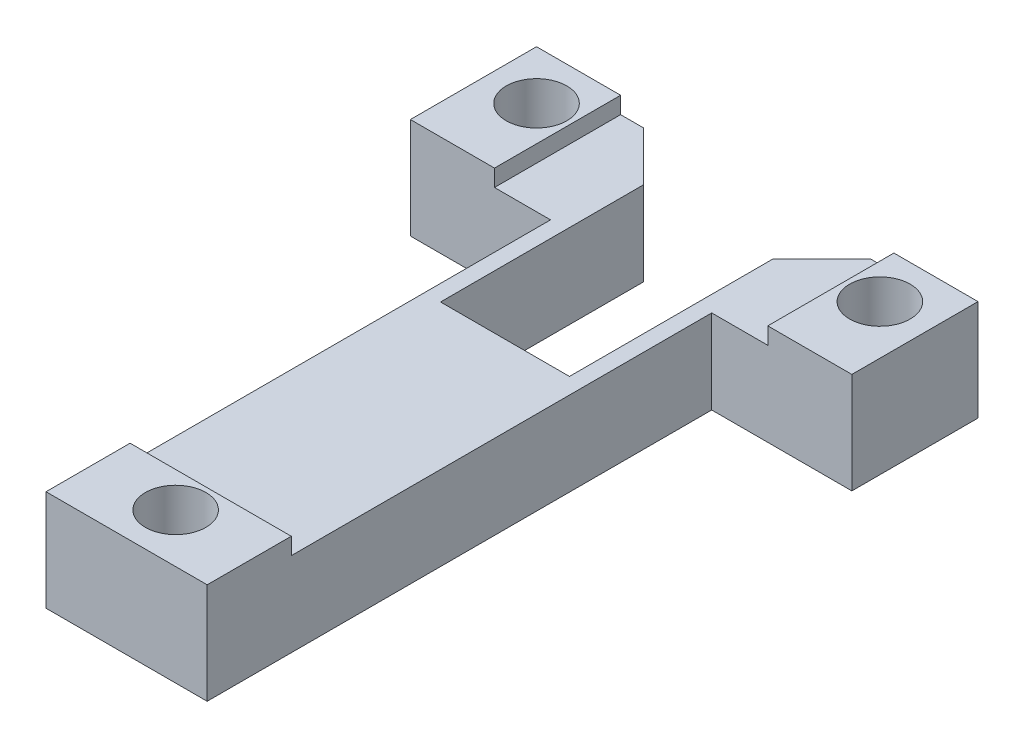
ISO-10303-21;
HEADER;
FILE_DESCRIPTION(('STEP AP214'),'2;1');
FILE_NAME('part.step','',(''),(''),'','','');
FILE_SCHEMA(('AUTOMOTIVE_DESIGN { 1 0 10303 214 1 1 1 1 }'));
ENDSEC;
DATA;
#1=APPLICATION_CONTEXT('core data for automotive mechanical design processes');
#2=APPLICATION_PROTOCOL_DEFINITION('international standard','automotive_design',2000,#1);
#3=PRODUCT_CONTEXT('',#1,'mechanical');
#4=PRODUCT('Part','Part','',(#3));
#5=PRODUCT_RELATED_PRODUCT_CATEGORY('part','',(#4));
#6=PRODUCT_DEFINITION_FORMATION('','',#4);
#7=PRODUCT_DEFINITION_CONTEXT('part definition',#1,'design');
#8=PRODUCT_DEFINITION('design','',#6,#7);
#9=PRODUCT_DEFINITION_SHAPE('','',#8);
#10=(LENGTH_UNIT() NAMED_UNIT(*) SI_UNIT(.MILLI.,.METRE.));
#11=(NAMED_UNIT(*) PLANE_ANGLE_UNIT() SI_UNIT($,.RADIAN.));
#12=(NAMED_UNIT(*) SI_UNIT($,.STERADIAN.) SOLID_ANGLE_UNIT());
#13=UNCERTAINTY_MEASURE_WITH_UNIT(LENGTH_MEASURE(1.E-05),#10,'distance_accuracy_value','');
#14=(GEOMETRIC_REPRESENTATION_CONTEXT(3) GLOBAL_UNCERTAINTY_ASSIGNED_CONTEXT((#13)) GLOBAL_UNIT_ASSIGNED_CONTEXT((#10,
#11,#12)) REPRESENTATION_CONTEXT('',''));
#15=CARTESIAN_POINT('',(0.,0.,0.));
#16=DIRECTION('',(0.,0.,1.));
#17=DIRECTION('',(1.,0.,0.));
#18=AXIS2_PLACEMENT_3D('',#15,#16,#17);
#19=CARTESIAN_POINT('',(0.,6.,0.));
#20=DIRECTION('',(0.,1.,0.));
#21=DIRECTION('',(0.,0.,1.));
#22=AXIS2_PLACEMENT_3D('',#19,#20,#21);
#23=PLANE('',#22);
#24=DIRECTION('',(-1.,0.,0.));
#25=VECTOR('',#24,1.);
#26=CARTESIAN_POINT('',(0.,6.,-45.));
#27=LINE('',#26,#25);
#28=CARTESIAN_POINT('',(15.5,6.,-45.));
#29=VERTEX_POINT('',#28);
#30=CARTESIAN_POINT('',(13.85,6.,-45.));
#31=VERTEX_POINT('',#30);
#32=EDGE_CURVE('E238',#29,#31,#27,.T.);
#33=ORIENTED_EDGE('',*,*,#32,.T.);
#34=DIRECTION('',(-0.707106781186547,0.,0.707106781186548));
#35=VECTOR('',#34,1.);
#36=CARTESIAN_POINT('',(-15.575,6.,-15.575));
#37=LINE('',#36,#35);
#38=CARTESIAN_POINT('',(10.35,6.,-41.5));
#39=VERTEX_POINT('',#38);
#40=EDGE_CURVE('E229',#31,#39,#37,.T.);
#41=ORIENTED_EDGE('',*,*,#40,.T.);
#42=DIRECTION('',(0.,0.,1.));
#43=VECTOR('',#42,1.);
#44=CARTESIAN_POINT('',(10.35,6.,0.));
#45=LINE('',#44,#43);
#46=CARTESIAN_POINT('',(10.35,6.,-27.));
#47=VERTEX_POINT('',#46);
#48=EDGE_CURVE('E380',#39,#47,#45,.T.);
#49=ORIENTED_EDGE('',*,*,#48,.T.);
#50=DIRECTION('',(-1.,0.,0.));
#51=VECTOR('',#50,1.);
#52=CARTESIAN_POINT('',(0.,6.,-27.));
#53=LINE('',#52,#51);
#54=CARTESIAN_POINT('',(1.15,6.,-27.));
#55=VERTEX_POINT('',#54);
#56=EDGE_CURVE('E345',#47,#55,#53,.T.);
#57=ORIENTED_EDGE('',*,*,#56,.T.);
#58=DIRECTION('',(0.,0.,1.));
#59=VECTOR('',#58,1.);
#60=CARTESIAN_POINT('',(1.15,6.,0.));
#61=LINE('',#60,#59);
#62=CARTESIAN_POINT('',(1.15,6.,-41.5));
#63=VERTEX_POINT('',#62);
#64=EDGE_CURVE('E227',#63,#55,#61,.T.);
#65=ORIENTED_EDGE('',*,*,#64,.F.);
#66=DIRECTION('',(0.707106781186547,0.,0.707106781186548));
#67=VECTOR('',#66,1.);
#68=CARTESIAN_POINT('',(21.325,6.,-21.325));
#69=LINE('',#68,#67);
#70=CARTESIAN_POINT('',(-2.35,6.,-45.));
#71=VERTEX_POINT('',#70);
#72=EDGE_CURVE('E212',#71,#63,#69,.T.);
#73=ORIENTED_EDGE('',*,*,#72,.F.);
#74=CARTESIAN_POINT('',(-4.,6.,-45.));
#75=VERTEX_POINT('',#74);
#76=EDGE_CURVE('E224',#71,#75,#27,.T.);
#77=ORIENTED_EDGE('',*,*,#76,.T.);
#78=DIRECTION('',(0.,0.,-1.));
#79=VECTOR('',#78,1.);
#80=CARTESIAN_POINT('',(-4.,6.,-45.));
#81=LINE('',#80,#79);
#82=CARTESIAN_POINT('',(-4.,6.,-36.));
#83=VERTEX_POINT('',#82);
#84=EDGE_CURVE('E420',#83,#75,#81,.T.);
#85=ORIENTED_EDGE('',*,*,#84,.F.);
#86=DIRECTION('',(1.,0.,0.));
#87=VECTOR('',#86,1.);
#88=CARTESIAN_POINT('',(0.,6.,-36.));
#89=LINE('',#88,#87);
#90=CARTESIAN_POINT('',(0.,6.,-36.));
#91=VERTEX_POINT('',#90);
#92=EDGE_CURVE('E239',#83,#91,#89,.T.);
#93=ORIENTED_EDGE('',*,*,#92,.T.);
#94=DIRECTION('',(0.,0.,-1.));
#95=VECTOR('',#94,1.);
#96=CARTESIAN_POINT('',(0.,6.,0.));
#97=LINE('',#96,#95);
#98=CARTESIAN_POINT('',(0.,6.,-6.));
#99=VERTEX_POINT('',#98);
#100=EDGE_CURVE('E297',#99,#91,#97,.T.);
#101=ORIENTED_EDGE('',*,*,#100,.F.);
#102=DIRECTION('',(-1.,0.,0.));
#103=VECTOR('',#102,1.);
#104=CARTESIAN_POINT('',(0.,6.,-6.));
#105=LINE('',#104,#103);
#106=CARTESIAN_POINT('',(11.5,6.,-6.));
#107=VERTEX_POINT('',#106);
#108=EDGE_CURVE('E393',#107,#99,#105,.T.);
#109=ORIENTED_EDGE('',*,*,#108,.F.);
#110=DIRECTION('',(0.,0.,-1.));
#111=VECTOR('',#110,1.);
#112=CARTESIAN_POINT('',(11.5,6.,0.));
#113=LINE('',#112,#111);
#114=CARTESIAN_POINT('',(11.5,6.,-36.));
#115=VERTEX_POINT('',#114);
#116=EDGE_CURVE('E294',#107,#115,#113,.T.);
#117=ORIENTED_EDGE('',*,*,#116,.T.);
#118=DIRECTION('',(-1.,0.,0.));
#119=VECTOR('',#118,1.);
#120=CARTESIAN_POINT('',(0.,6.,-36.));
#121=LINE('',#120,#119);
#122=CARTESIAN_POINT('',(15.5,6.,-36.));
#123=VERTEX_POINT('',#122);
#124=EDGE_CURVE('E272',#123,#115,#121,.T.);
#125=ORIENTED_EDGE('',*,*,#124,.F.);
#126=DIRECTION('',(0.,0.,1.));
#127=VECTOR('',#126,1.);
#128=CARTESIAN_POINT('',(15.5,6.,-45.));
#129=LINE('',#128,#127);
#130=EDGE_CURVE('E416',#29,#123,#129,.T.);
#131=ORIENTED_EDGE('',*,*,#130,.F.);
#132=EDGE_LOOP('',(#33,#41,#49,#57,#65,#73,#77,#85,#93,#101,#109,#117,#125,#131));
#133=FACE_BOUND('',#132,.T.);
#134=ADVANCED_FACE('F73',(#133),#23,.T.);
#135=CARTESIAN_POINT('',(0.,6.,-45.));
#136=DIRECTION('',(0.,0.,1.));
#137=DIRECTION('',(1.,0.,0.));
#138=AXIS2_PLACEMENT_3D('',#135,#136,#137);
#139=PLANE('',#138);
#140=DIRECTION('',(0.,-1.,0.));
#141=VECTOR('',#140,1.);
#142=CARTESIAN_POINT('',(13.85,7.2,-45.));
#143=LINE('',#142,#141);
#144=CARTESIAN_POINT('',(13.85,0.,-45.));
#145=VERTEX_POINT('',#144);
#146=EDGE_CURVE('E219',#31,#145,#143,.T.);
#147=ORIENTED_EDGE('',*,*,#146,.F.);
#148=ORIENTED_EDGE('',*,*,#32,.F.);
#149=DIRECTION('',(0.,-1.,0.));
#150=VECTOR('',#149,1.);
#151=CARTESIAN_POINT('',(15.5,7.2,-45.));
#152=LINE('',#151,#150);
#153=CARTESIAN_POINT('',(15.5,7.2,-45.));
#154=VERTEX_POINT('',#153);
#155=EDGE_CURVE('E396',#154,#29,#152,.T.);
#156=ORIENTED_EDGE('',*,*,#155,.F.);
#157=DIRECTION('',(-1.,0.,0.));
#158=VECTOR('',#157,1.);
#159=CARTESIAN_POINT('',(21.5,7.2,-45.));
#160=LINE('',#159,#158);
#161=CARTESIAN_POINT('',(21.5,7.2,-45.));
#162=VERTEX_POINT('',#161);
#163=EDGE_CURVE('E421',#162,#154,#160,.T.);
#164=ORIENTED_EDGE('',*,*,#163,.F.);
#165=DIRECTION('',(0.,-1.,0.));
#166=VECTOR('',#165,1.);
#167=CARTESIAN_POINT('',(21.5,6.,-45.));
#168=LINE('',#167,#166);
#169=CARTESIAN_POINT('',(21.5,0.,-45.));
#170=VERTEX_POINT('',#169);
#171=EDGE_CURVE('E288',#162,#170,#168,.T.);
#172=ORIENTED_EDGE('',*,*,#171,.T.);
#173=DIRECTION('',(-1.,0.,0.));
#174=VECTOR('',#173,1.);
#175=CARTESIAN_POINT('',(0.,0.,-45.));
#176=LINE('',#175,#174);
#177=EDGE_CURVE('E245',#170,#145,#176,.T.);
#178=ORIENTED_EDGE('',*,*,#177,.T.);
#179=EDGE_LOOP('',(#147,#148,#156,#164,#172,#178));
#180=FACE_BOUND('',#179,.T.);
#181=ADVANCED_FACE('F491',(#180),#139,.F.);
#182=CARTESIAN_POINT('',(-9.99999999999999,6.,0.));
#183=DIRECTION('',(1.,0.,0.));
#184=DIRECTION('',(0.,0.,-1.));
#185=AXIS2_PLACEMENT_3D('',#182,#183,#184);
#186=PLANE('',#185);
#187=DIRECTION('',(0.,0.,1.));
#188=VECTOR('',#187,1.);
#189=CARTESIAN_POINT('',(-9.99999999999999,0.,0.));
#190=LINE('',#189,#188);
#191=CARTESIAN_POINT('',(-10.,0.,-45.));
#192=VERTEX_POINT('',#191);
#193=CARTESIAN_POINT('',(-10.,0.,-36.));
#194=VERTEX_POINT('',#193);
#195=EDGE_CURVE('E249',#192,#194,#190,.T.);
#196=ORIENTED_EDGE('',*,*,#195,.T.);
#197=DIRECTION('',(0.,-1.,0.));
#198=VECTOR('',#197,1.);
#199=CARTESIAN_POINT('',(-10.,6.,-36.));
#200=LINE('',#199,#198);
#201=CARTESIAN_POINT('',(-10.,7.2,-36.));
#202=VERTEX_POINT('',#201);
#203=EDGE_CURVE('E268',#202,#194,#200,.T.);
#204=ORIENTED_EDGE('',*,*,#203,.F.);
#205=DIRECTION('',(0.,0.,1.));
#206=VECTOR('',#205,1.);
#207=CARTESIAN_POINT('',(-10.,7.2,-45.));
#208=LINE('',#207,#206);
#209=CARTESIAN_POINT('',(-10.,7.2,-45.));
#210=VERTEX_POINT('',#209);
#211=EDGE_CURVE('E439',#210,#202,#208,.T.);
#212=ORIENTED_EDGE('',*,*,#211,.F.);
#213=DIRECTION('',(0.,-1.,0.));
#214=VECTOR('',#213,1.);
#215=CARTESIAN_POINT('',(-10.,6.,-45.));
#216=LINE('',#215,#214);
#217=EDGE_CURVE('E243',#210,#192,#216,.T.);
#218=ORIENTED_EDGE('',*,*,#217,.T.);
#219=EDGE_LOOP('',(#196,#204,#212,#218));
#220=FACE_BOUND('',#219,.T.);
#221=ADVANCED_FACE('F472',(#220),#186,.F.);
#222=CARTESIAN_POINT('',(0.,6.,-36.));
#223=DIRECTION('',(0.,0.,-1.));
#224=DIRECTION('',(-1.,0.,0.));
#225=AXIS2_PLACEMENT_3D('',#222,#223,#224);
#226=PLANE('',#225);
#227=DIRECTION('',(1.,0.,0.));
#228=VECTOR('',#227,1.);
#229=CARTESIAN_POINT('',(0.,0.,-36.));
#230=LINE('',#229,#228);
#231=CARTESIAN_POINT('',(0.,0.,-36.));
#232=VERTEX_POINT('',#231);
#233=EDGE_CURVE('E253',#194,#232,#230,.T.);
#234=ORIENTED_EDGE('',*,*,#233,.T.);
#235=DIRECTION('',(0.,-1.,0.));
#236=VECTOR('',#235,1.);
#237=CARTESIAN_POINT('',(0.,6.,-36.));
#238=LINE('',#237,#236);
#239=EDGE_CURVE('E265',#91,#232,#238,.T.);
#240=ORIENTED_EDGE('',*,*,#239,.F.);
#241=ORIENTED_EDGE('',*,*,#92,.F.);
#242=DIRECTION('',(0.,-1.,0.));
#243=VECTOR('',#242,1.);
#244=CARTESIAN_POINT('',(-4.,7.2,-36.));
#245=LINE('',#244,#243);
#246=CARTESIAN_POINT('',(-4.,7.2,-36.));
#247=VERTEX_POINT('',#246);
#248=EDGE_CURVE('E307',#247,#83,#245,.T.);
#249=ORIENTED_EDGE('',*,*,#248,.F.);
#250=DIRECTION('',(1.,0.,0.));
#251=VECTOR('',#250,1.);
#252=CARTESIAN_POINT('',(-10.,7.2,-36.));
#253=LINE('',#252,#251);
#254=EDGE_CURVE('E443',#202,#247,#253,.T.);
#255=ORIENTED_EDGE('',*,*,#254,.F.);
#256=ORIENTED_EDGE('',*,*,#203,.T.);
#257=EDGE_LOOP('',(#234,#240,#241,#249,#255,#256));
#258=FACE_BOUND('',#257,.T.);
#259=ADVANCED_FACE('F461',(#258),#226,.F.);
#260=ORIENTED_EDGE('',*,*,#76,.F.);
#261=DIRECTION('',(0.,-1.,0.));
#262=VECTOR('',#261,1.);
#263=CARTESIAN_POINT('',(-2.35,7.2,-45.));
#264=LINE('',#263,#262);
#265=CARTESIAN_POINT('',(-2.35,0.,-45.));
#266=VERTEX_POINT('',#265);
#267=EDGE_CURVE('E209',#71,#266,#264,.T.);
#268=ORIENTED_EDGE('',*,*,#267,.T.);
#269=EDGE_CURVE('E258',#266,#192,#176,.T.);
#270=ORIENTED_EDGE('',*,*,#269,.T.);
#271=ORIENTED_EDGE('',*,*,#217,.F.);
#272=DIRECTION('',(-1.,0.,0.));
#273=VECTOR('',#272,1.);
#274=CARTESIAN_POINT('',(-4.,7.2,-45.));
#275=LINE('',#274,#273);
#276=CARTESIAN_POINT('',(-4.,7.2,-45.));
#277=VERTEX_POINT('',#276);
#278=EDGE_CURVE('E435',#277,#210,#275,.T.);
#279=ORIENTED_EDGE('',*,*,#278,.F.);
#280=DIRECTION('',(0.,-1.,0.));
#281=VECTOR('',#280,1.);
#282=CARTESIAN_POINT('',(-4.,7.2,-45.));
#283=LINE('',#282,#281);
#284=EDGE_CURVE('E236',#277,#75,#283,.T.);
#285=ORIENTED_EDGE('',*,*,#284,.T.);
#286=EDGE_LOOP('',(#260,#268,#270,#271,#279,#285));
#287=FACE_BOUND('',#286,.T.);
#288=ADVANCED_FACE('F233',(#287),#139,.F.);
#289=CARTESIAN_POINT('',(0.,0.,0.));
#290=DIRECTION('',(0.,1.,0.));
#291=DIRECTION('',(0.,0.,1.));
#292=AXIS2_PLACEMENT_3D('',#289,#290,#291);
#293=PLANE('',#292);
#294=CARTESIAN_POINT('',(5.75000000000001,0.,-3.5));
#295=DIRECTION('',(0.,1.,0.));
#296=DIRECTION('',(0.,0.,1.));
#297=AXIS2_PLACEMENT_3D('',#294,#295,#296);
#298=CIRCLE('',#297,2.16);
#299=CARTESIAN_POINT('',(5.75000000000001,0.,-1.34));
#300=VERTEX_POINT('',#299);
#301=EDGE_CURVE('E366',#300,#300,#298,.F.);
#302=ORIENTED_EDGE('',*,*,#301,.F.);
#303=EDGE_LOOP('',(#302));
#304=FACE_BOUND('',#303,.T.);
#305=DIRECTION('',(-0.707106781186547,0.,0.707106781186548));
#306=VECTOR('',#305,1.);
#307=CARTESIAN_POINT('',(-15.575,0.,-15.575));
#308=LINE('',#307,#306);
#309=CARTESIAN_POINT('',(10.35,0.,-41.5));
#310=VERTEX_POINT('',#309);
#311=EDGE_CURVE('E12',#145,#310,#308,.T.);
#312=ORIENTED_EDGE('',*,*,#311,.F.);
#313=ORIENTED_EDGE('',*,*,#177,.F.);
#314=DIRECTION('',(0.,0.,1.));
#315=VECTOR('',#314,1.);
#316=CARTESIAN_POINT('',(21.5,0.,0.));
#317=LINE('',#316,#315);
#318=CARTESIAN_POINT('',(21.5,0.,-36.));
#319=VERTEX_POINT('',#318);
#320=EDGE_CURVE('E277',#170,#319,#317,.T.);
#321=ORIENTED_EDGE('',*,*,#320,.T.);
#322=DIRECTION('',(-1.,0.,0.));
#323=VECTOR('',#322,1.);
#324=CARTESIAN_POINT('',(0.,0.,-36.));
#325=LINE('',#324,#323);
#326=CARTESIAN_POINT('',(11.5,0.,-36.));
#327=VERTEX_POINT('',#326);
#328=EDGE_CURVE('E278',#319,#327,#325,.T.);
#329=ORIENTED_EDGE('',*,*,#328,.T.);
#330=DIRECTION('',(0.,0.,-1.));
#331=VECTOR('',#330,1.);
#332=CARTESIAN_POINT('',(11.5,0.,0.));
#333=LINE('',#332,#331);
#334=CARTESIAN_POINT('',(11.5,0.,0.));
#335=VERTEX_POINT('',#334);
#336=EDGE_CURVE('E306',#335,#327,#333,.T.);
#337=ORIENTED_EDGE('',*,*,#336,.F.);
#338=DIRECTION('',(1.,0.,0.));
#339=VECTOR('',#338,1.);
#340=CARTESIAN_POINT('',(0.,0.,0.));
#341=LINE('',#340,#339);
#342=CARTESIAN_POINT('',(0.,0.,0.));
#343=VERTEX_POINT('',#342);
#344=EDGE_CURVE('E302',#343,#335,#341,.T.);
#345=ORIENTED_EDGE('',*,*,#344,.F.);
#346=DIRECTION('',(0.,0.,-1.));
#347=VECTOR('',#346,1.);
#348=CARTESIAN_POINT('',(0.,0.,0.));
#349=LINE('',#348,#347);
#350=EDGE_CURVE('E298',#343,#232,#349,.T.);
#351=ORIENTED_EDGE('',*,*,#350,.T.);
#352=ORIENTED_EDGE('',*,*,#233,.F.);
#353=ORIENTED_EDGE('',*,*,#195,.F.);
#354=ORIENTED_EDGE('',*,*,#269,.F.);
#355=DIRECTION('',(0.707106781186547,0.,0.707106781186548));
#356=VECTOR('',#355,1.);
#357=CARTESIAN_POINT('',(21.325,0.,-21.325));
#358=LINE('',#357,#356);
#359=CARTESIAN_POINT('',(1.15,0.,-41.5));
#360=VERTEX_POINT('',#359);
#361=EDGE_CURVE('E214',#266,#360,#358,.T.);
#362=ORIENTED_EDGE('',*,*,#361,.T.);
#363=DIRECTION('',(0.,0.,1.));
#364=VECTOR('',#363,1.);
#365=CARTESIAN_POINT('',(1.15,0.,0.));
#366=LINE('',#365,#364);
#367=CARTESIAN_POINT('',(1.15,0.,-27.));
#368=VERTEX_POINT('',#367);
#369=EDGE_CURVE('E321',#360,#368,#366,.T.);
#370=ORIENTED_EDGE('',*,*,#369,.T.);
#371=DIRECTION('',(-1.,0.,0.));
#372=VECTOR('',#371,1.);
#373=CARTESIAN_POINT('',(0.,0.,-27.));
#374=LINE('',#373,#372);
#375=CARTESIAN_POINT('',(10.35,0.,-27.));
#376=VERTEX_POINT('',#375);
#377=EDGE_CURVE('E325',#376,#368,#374,.T.);
#378=ORIENTED_EDGE('',*,*,#377,.F.);
#379=DIRECTION('',(0.,0.,1.));
#380=VECTOR('',#379,1.);
#381=CARTESIAN_POINT('',(10.35,0.,0.));
#382=LINE('',#381,#380);
#383=EDGE_CURVE('E82',#310,#376,#382,.T.);
#384=ORIENTED_EDGE('',*,*,#383,.F.);
#385=EDGE_LOOP('',(#312,#313,#321,#329,#337,#345,#351,#352,#353,#354,#362,#370,#378,#384));
#386=FACE_BOUND('',#385,.T.);
#387=CARTESIAN_POINT('',(-6.5,0.,-41.5));
#388=DIRECTION('',(0.,1.,0.));
#389=DIRECTION('',(0.,0.,1.));
#390=AXIS2_PLACEMENT_3D('',#387,#388,#389);
#391=CIRCLE('',#390,2.16);
#392=CARTESIAN_POINT('',(-6.5,0.,-39.34));
#393=VERTEX_POINT('',#392);
#394=EDGE_CURVE('E230',#393,#393,#391,.F.);
#395=ORIENTED_EDGE('',*,*,#394,.F.);
#396=EDGE_LOOP('',(#395));
#397=FACE_BOUND('',#396,.T.);
#398=CARTESIAN_POINT('',(18.,0.,-41.5));
#399=DIRECTION('',(0.,1.,0.));
#400=DIRECTION('',(0.,0.,1.));
#401=AXIS2_PLACEMENT_3D('',#398,#399,#400);
#402=CIRCLE('',#401,2.16);
#403=CARTESIAN_POINT('',(18.,0.,-39.34));
#404=VERTEX_POINT('',#403);
#405=EDGE_CURVE('E370',#404,#404,#402,.F.);
#406=ORIENTED_EDGE('',*,*,#405,.F.);
#407=EDGE_LOOP('',(#406));
#408=FACE_BOUND('',#407,.T.);
#409=ADVANCED_FACE('F349',(#304,#386,#397,#408),#293,.F.);
#410=CARTESIAN_POINT('',(21.5,6.,0.));
#411=DIRECTION('',(1.,0.,0.));
#412=DIRECTION('',(0.,0.,-1.));
#413=AXIS2_PLACEMENT_3D('',#410,#411,#412);
#414=PLANE('',#413);
#415=ORIENTED_EDGE('',*,*,#320,.F.);
#416=ORIENTED_EDGE('',*,*,#171,.F.);
#417=DIRECTION('',(0.,0.,-1.));
#418=VECTOR('',#417,1.);
#419=CARTESIAN_POINT('',(21.5,7.2,-36.));
#420=LINE('',#419,#418);
#421=CARTESIAN_POINT('',(21.5,7.2,-36.));
#422=VERTEX_POINT('',#421);
#423=EDGE_CURVE('E415',#422,#162,#420,.T.);
#424=ORIENTED_EDGE('',*,*,#423,.F.);
#425=DIRECTION('',(0.,-1.,0.));
#426=VECTOR('',#425,1.);
#427=CARTESIAN_POINT('',(21.5,6.,-36.));
#428=LINE('',#427,#426);
#429=EDGE_CURVE('E254',#422,#319,#428,.T.);
#430=ORIENTED_EDGE('',*,*,#429,.T.);
#431=EDGE_LOOP('',(#415,#416,#424,#430));
#432=FACE_BOUND('',#431,.T.);
#433=ADVANCED_FACE('F498',(#432),#414,.T.);
#434=CARTESIAN_POINT('',(0.,6.,-36.));
#435=DIRECTION('',(0.,0.,1.));
#436=DIRECTION('',(1.,0.,0.));
#437=AXIS2_PLACEMENT_3D('',#434,#435,#436);
#438=PLANE('',#437);
#439=ORIENTED_EDGE('',*,*,#328,.F.);
#440=ORIENTED_EDGE('',*,*,#429,.F.);
#441=DIRECTION('',(1.,0.,0.));
#442=VECTOR('',#441,1.);
#443=CARTESIAN_POINT('',(15.5,7.2,-36.));
#444=LINE('',#443,#442);
#445=CARTESIAN_POINT('',(15.5,7.2,-36.));
#446=VERTEX_POINT('',#445);
#447=EDGE_CURVE('E425',#446,#422,#444,.T.);
#448=ORIENTED_EDGE('',*,*,#447,.F.);
#449=DIRECTION('',(0.,-1.,0.));
#450=VECTOR('',#449,1.);
#451=CARTESIAN_POINT('',(15.5,7.2,-36.));
#452=LINE('',#451,#450);
#453=EDGE_CURVE('E412',#446,#123,#452,.T.);
#454=ORIENTED_EDGE('',*,*,#453,.T.);
#455=ORIENTED_EDGE('',*,*,#124,.T.);
#456=DIRECTION('',(0.,-1.,0.));
#457=VECTOR('',#456,1.);
#458=CARTESIAN_POINT('',(11.5,6.,-36.));
#459=LINE('',#458,#457);
#460=EDGE_CURVE('E276',#115,#327,#459,.T.);
#461=ORIENTED_EDGE('',*,*,#460,.T.);
#462=EDGE_LOOP('',(#439,#440,#448,#454,#455,#461));
#463=FACE_BOUND('',#462,.T.);
#464=ADVANCED_FACE('F510',(#463),#438,.T.);
#465=CARTESIAN_POINT('',(11.5,6.,0.));
#466=DIRECTION('',(-1.,0.,0.));
#467=DIRECTION('',(0.,0.,1.));
#468=AXIS2_PLACEMENT_3D('',#465,#466,#467);
#469=PLANE('',#468);
#470=ORIENTED_EDGE('',*,*,#460,.F.);
#471=ORIENTED_EDGE('',*,*,#116,.F.);
#472=DIRECTION('',(0.,-1.,0.));
#473=VECTOR('',#472,1.);
#474=CARTESIAN_POINT('',(11.5,7.2,-6.));
#475=LINE('',#474,#473);
#476=CARTESIAN_POINT('',(11.5,7.2,-6.));
#477=VERTEX_POINT('',#476);
#478=EDGE_CURVE('E387',#477,#107,#475,.T.);
#479=ORIENTED_EDGE('',*,*,#478,.F.);
#480=DIRECTION('',(0.,0.,-1.));
#481=VECTOR('',#480,1.);
#482=CARTESIAN_POINT('',(11.5,7.2,0.));
#483=LINE('',#482,#481);
#484=CARTESIAN_POINT('',(11.5,7.2,0.));
#485=VERTEX_POINT('',#484);
#486=EDGE_CURVE('E400',#485,#477,#483,.T.);
#487=ORIENTED_EDGE('',*,*,#486,.F.);
#488=DIRECTION('',(0.,-1.,0.));
#489=VECTOR('',#488,1.);
#490=CARTESIAN_POINT('',(11.5,6.,0.));
#491=LINE('',#490,#489);
#492=EDGE_CURVE('E282',#485,#335,#491,.T.);
#493=ORIENTED_EDGE('',*,*,#492,.T.);
#494=ORIENTED_EDGE('',*,*,#336,.T.);
#495=EDGE_LOOP('',(#470,#471,#479,#487,#493,#494));
#496=FACE_BOUND('',#495,.T.);
#497=ADVANCED_FACE('F514',(#496),#469,.F.);
#498=CARTESIAN_POINT('',(0.,6.,0.));
#499=DIRECTION('',(0.,0.,-1.));
#500=DIRECTION('',(-1.,0.,0.));
#501=AXIS2_PLACEMENT_3D('',#498,#499,#500);
#502=PLANE('',#501);
#503=ORIENTED_EDGE('',*,*,#344,.T.);
#504=ORIENTED_EDGE('',*,*,#492,.F.);
#505=DIRECTION('',(1.,0.,0.));
#506=VECTOR('',#505,1.);
#507=CARTESIAN_POINT('',(0.,7.2,0.));
#508=LINE('',#507,#506);
#509=CARTESIAN_POINT('',(0.,7.2,0.));
#510=VERTEX_POINT('',#509);
#511=EDGE_CURVE('E403',#510,#485,#508,.T.);
#512=ORIENTED_EDGE('',*,*,#511,.F.);
#513=DIRECTION('',(0.,-1.,0.));
#514=VECTOR('',#513,1.);
#515=CARTESIAN_POINT('',(0.,6.,0.));
#516=LINE('',#515,#514);
#517=EDGE_CURVE('E301',#510,#343,#516,.T.);
#518=ORIENTED_EDGE('',*,*,#517,.T.);
#519=EDGE_LOOP('',(#503,#504,#512,#518));
#520=FACE_BOUND('',#519,.T.);
#521=ADVANCED_FACE('F75',(#520),#502,.F.);
#522=CARTESIAN_POINT('',(0.,6.,0.));
#523=DIRECTION('',(-1.,0.,0.));
#524=DIRECTION('',(0.,0.,1.));
#525=AXIS2_PLACEMENT_3D('',#522,#523,#524);
#526=PLANE('',#525);
#527=ORIENTED_EDGE('',*,*,#517,.F.);
#528=DIRECTION('',(0.,0.,1.));
#529=VECTOR('',#528,1.);
#530=CARTESIAN_POINT('',(0.,7.2,-6.));
#531=LINE('',#530,#529);
#532=CARTESIAN_POINT('',(0.,7.2,-6.));
#533=VERTEX_POINT('',#532);
#534=EDGE_CURVE('E397',#533,#510,#531,.T.);
#535=ORIENTED_EDGE('',*,*,#534,.F.);
#536=DIRECTION('',(0.,-1.,0.));
#537=VECTOR('',#536,1.);
#538=CARTESIAN_POINT('',(0.,7.2,-6.));
#539=LINE('',#538,#537);
#540=EDGE_CURVE('E97',#533,#99,#539,.T.);
#541=ORIENTED_EDGE('',*,*,#540,.T.);
#542=ORIENTED_EDGE('',*,*,#100,.T.);
#543=ORIENTED_EDGE('',*,*,#239,.T.);
#544=ORIENTED_EDGE('',*,*,#350,.F.);
#545=EDGE_LOOP('',(#527,#535,#541,#542,#543,#544));
#546=FACE_BOUND('',#545,.T.);
#547=ADVANCED_FACE('F466',(#546),#526,.T.);
#548=CARTESIAN_POINT('',(-4.,7.2,-45.));
#549=DIRECTION('',(-1.,0.,0.));
#550=DIRECTION('',(0.,0.,1.));
#551=AXIS2_PLACEMENT_3D('',#548,#549,#550);
#552=PLANE('',#551);
#553=ORIENTED_EDGE('',*,*,#84,.T.);
#554=ORIENTED_EDGE('',*,*,#284,.F.);
#555=DIRECTION('',(0.,0.,-1.));
#556=VECTOR('',#555,1.);
#557=CARTESIAN_POINT('',(-4.,7.2,-45.));
#558=LINE('',#557,#556);
#559=EDGE_CURVE('E446',#247,#277,#558,.T.);
#560=ORIENTED_EDGE('',*,*,#559,.F.);
#561=ORIENTED_EDGE('',*,*,#248,.T.);
#562=EDGE_LOOP('',(#553,#554,#560,#561));
#563=FACE_BOUND('',#562,.T.);
#564=ADVANCED_FACE('F457',(#563),#552,.F.);
#565=CARTESIAN_POINT('',(0.,7.2,0.));
#566=DIRECTION('',(0.,1.,0.));
#567=DIRECTION('',(0.,0.,1.));
#568=AXIS2_PLACEMENT_3D('',#565,#566,#567);
#569=PLANE('',#568);
#570=CARTESIAN_POINT('',(-6.5,7.2,-41.5));
#571=DIRECTION('',(0.,1.,0.));
#572=DIRECTION('',(0.,0.,1.));
#573=AXIS2_PLACEMENT_3D('',#570,#571,#572);
#574=CIRCLE('',#573,2.16);
#575=CARTESIAN_POINT('',(-6.5,7.2,-39.34));
#576=VERTEX_POINT('',#575);
#577=EDGE_CURVE('E354',#576,#576,#574,.T.);
#578=ORIENTED_EDGE('',*,*,#577,.F.);
#579=EDGE_LOOP('',(#578));
#580=FACE_BOUND('',#579,.T.);
#581=ORIENTED_EDGE('',*,*,#278,.T.);
#582=ORIENTED_EDGE('',*,*,#211,.T.);
#583=ORIENTED_EDGE('',*,*,#254,.T.);
#584=ORIENTED_EDGE('',*,*,#559,.T.);
#585=EDGE_LOOP('',(#581,#582,#583,#584));
#586=FACE_BOUND('',#585,.T.);
#587=ADVANCED_FACE('F475',(#580,#586),#569,.T.);
#588=CARTESIAN_POINT('',(15.5,7.2,-45.));
#589=DIRECTION('',(1.,0.,0.));
#590=DIRECTION('',(0.,0.,-1.));
#591=AXIS2_PLACEMENT_3D('',#588,#589,#590);
#592=PLANE('',#591);
#593=ORIENTED_EDGE('',*,*,#130,.T.);
#594=ORIENTED_EDGE('',*,*,#453,.F.);
#595=DIRECTION('',(0.,0.,1.));
#596=VECTOR('',#595,1.);
#597=CARTESIAN_POINT('',(15.5,7.2,-45.));
#598=LINE('',#597,#596);
#599=EDGE_CURVE('E429',#154,#446,#598,.T.);
#600=ORIENTED_EDGE('',*,*,#599,.F.);
#601=ORIENTED_EDGE('',*,*,#155,.T.);
#602=EDGE_LOOP('',(#593,#594,#600,#601));
#603=FACE_BOUND('',#602,.T.);
#604=ADVANCED_FACE('F477',(#603),#592,.F.);
#605=CARTESIAN_POINT('',(0.,7.2,0.));
#606=DIRECTION('',(0.,1.,0.));
#607=DIRECTION('',(0.,0.,1.));
#608=AXIS2_PLACEMENT_3D('',#605,#606,#607);
#609=PLANE('',#608);
#610=CARTESIAN_POINT('',(18.,7.2,-41.5));
#611=DIRECTION('',(0.,1.,0.));
#612=DIRECTION('',(0.,0.,1.));
#613=AXIS2_PLACEMENT_3D('',#610,#611,#612);
#614=CIRCLE('',#613,2.16);
#615=CARTESIAN_POINT('',(18.,7.2,-39.34));
#616=VERTEX_POINT('',#615);
#617=EDGE_CURVE('E358',#616,#616,#614,.T.);
#618=ORIENTED_EDGE('',*,*,#617,.F.);
#619=EDGE_LOOP('',(#618));
#620=FACE_BOUND('',#619,.T.);
#621=ORIENTED_EDGE('',*,*,#163,.T.);
#622=ORIENTED_EDGE('',*,*,#599,.T.);
#623=ORIENTED_EDGE('',*,*,#447,.T.);
#624=ORIENTED_EDGE('',*,*,#423,.T.);
#625=EDGE_LOOP('',(#621,#622,#623,#624));
#626=FACE_BOUND('',#625,.T.);
#627=ADVANCED_FACE('F484',(#620,#626),#609,.T.);
#628=CARTESIAN_POINT('',(0.,7.2,-6.));
#629=DIRECTION('',(0.,0.,1.));
#630=DIRECTION('',(1.,0.,0.));
#631=AXIS2_PLACEMENT_3D('',#628,#629,#630);
#632=PLANE('',#631);
#633=ORIENTED_EDGE('',*,*,#108,.T.);
#634=ORIENTED_EDGE('',*,*,#540,.F.);
#635=DIRECTION('',(-1.,0.,0.));
#636=VECTOR('',#635,1.);
#637=CARTESIAN_POINT('',(0.,7.2,-6.));
#638=LINE('',#637,#636);
#639=EDGE_CURVE('E392',#477,#533,#638,.T.);
#640=ORIENTED_EDGE('',*,*,#639,.F.);
#641=ORIENTED_EDGE('',*,*,#478,.T.);
#642=EDGE_LOOP('',(#633,#634,#640,#641));
#643=FACE_BOUND('',#642,.T.);
#644=ADVANCED_FACE('F551',(#643),#632,.F.);
#645=CARTESIAN_POINT('',(0.,7.2,0.));
#646=DIRECTION('',(0.,1.,0.));
#647=DIRECTION('',(0.,0.,1.));
#648=AXIS2_PLACEMENT_3D('',#645,#646,#647);
#649=PLANE('',#648);
#650=CARTESIAN_POINT('',(5.75000000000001,7.2,-3.5));
#651=DIRECTION('',(0.,1.,0.));
#652=DIRECTION('',(0.,0.,1.));
#653=AXIS2_PLACEMENT_3D('',#650,#651,#652);
#654=CIRCLE('',#653,2.16);
#655=CARTESIAN_POINT('',(5.75000000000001,7.2,-1.34));
#656=VERTEX_POINT('',#655);
#657=EDGE_CURVE('E364',#656,#656,#654,.T.);
#658=ORIENTED_EDGE('',*,*,#657,.F.);
#659=EDGE_LOOP('',(#658));
#660=FACE_BOUND('',#659,.T.);
#661=ORIENTED_EDGE('',*,*,#534,.T.);
#662=ORIENTED_EDGE('',*,*,#511,.T.);
#663=ORIENTED_EDGE('',*,*,#486,.T.);
#664=ORIENTED_EDGE('',*,*,#639,.T.);
#665=EDGE_LOOP('',(#661,#662,#663,#664));
#666=FACE_BOUND('',#665,.T.);
#667=ADVANCED_FACE('F548',(#660,#666),#649,.T.);
#668=CARTESIAN_POINT('',(5.75000000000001,7.2,-3.5));
#669=DIRECTION('',(0.,-1.,0.));
#670=DIRECTION('',(0.,0.,-1.));
#671=AXIS2_PLACEMENT_3D('',#668,#669,#670);
#672=CYLINDRICAL_SURFACE('',#671,2.16);
#673=ORIENTED_EDGE('',*,*,#657,.T.);
#674=EDGE_LOOP('',(#673));
#675=FACE_BOUND('',#674,.T.);
#676=ORIENTED_EDGE('',*,*,#301,.T.);
#677=EDGE_LOOP('',(#676));
#678=FACE_BOUND('',#677,.T.);
#679=ADVANCED_FACE('F545',(#675,#678),#672,.F.);
#680=CARTESIAN_POINT('',(18.,7.2,-41.5));
#681=DIRECTION('',(0.,-1.,0.));
#682=DIRECTION('',(0.,0.,-1.));
#683=AXIS2_PLACEMENT_3D('',#680,#681,#682);
#684=CYLINDRICAL_SURFACE('',#683,2.16);
#685=ORIENTED_EDGE('',*,*,#617,.T.);
#686=EDGE_LOOP('',(#685));
#687=FACE_BOUND('',#686,.T.);
#688=ORIENTED_EDGE('',*,*,#405,.T.);
#689=EDGE_LOOP('',(#688));
#690=FACE_BOUND('',#689,.T.);
#691=ADVANCED_FACE('F567',(#687,#690),#684,.F.);
#692=CARTESIAN_POINT('',(-6.5,7.2,-41.5));
#693=DIRECTION('',(0.,-1.,0.));
#694=DIRECTION('',(0.,0.,-1.));
#695=AXIS2_PLACEMENT_3D('',#692,#693,#694);
#696=CYLINDRICAL_SURFACE('',#695,2.16);
#697=ORIENTED_EDGE('',*,*,#577,.T.);
#698=EDGE_LOOP('',(#697));
#699=FACE_BOUND('',#698,.T.);
#700=ORIENTED_EDGE('',*,*,#394,.T.);
#701=EDGE_LOOP('',(#700));
#702=FACE_BOUND('',#701,.T.);
#703=ADVANCED_FACE('F564',(#699,#702),#696,.F.);
#704=CARTESIAN_POINT('',(1.15,7.2,0.));
#705=DIRECTION('',(-1.,0.,0.));
#706=DIRECTION('',(0.,0.,1.));
#707=AXIS2_PLACEMENT_3D('',#704,#705,#706);
#708=PLANE('',#707);
#709=ORIENTED_EDGE('',*,*,#64,.T.);
#710=DIRECTION('',(0.,-1.,0.));
#711=VECTOR('',#710,1.);
#712=CARTESIAN_POINT('',(1.15,7.2,-27.));
#713=LINE('',#712,#711);
#714=EDGE_CURVE('E347',#55,#368,#713,.T.);
#715=ORIENTED_EDGE('',*,*,#714,.T.);
#716=ORIENTED_EDGE('',*,*,#369,.F.);
#717=DIRECTION('',(0.,-1.,0.));
#718=VECTOR('',#717,1.);
#719=CARTESIAN_POINT('',(1.15,7.2,-41.5));
#720=LINE('',#719,#718);
#721=EDGE_CURVE('E89',#63,#360,#720,.T.);
#722=ORIENTED_EDGE('',*,*,#721,.F.);
#723=EDGE_LOOP('',(#709,#715,#716,#722));
#724=FACE_BOUND('',#723,.T.);
#725=ADVANCED_FACE('F352',(#724),#708,.F.);
#726=CARTESIAN_POINT('',(0.,7.2,-27.));
#727=DIRECTION('',(0.,0.,-1.));
#728=DIRECTION('',(-1.,0.,0.));
#729=AXIS2_PLACEMENT_3D('',#726,#727,#728);
#730=PLANE('',#729);
#731=DIRECTION('',(0.,-1.,0.));
#732=VECTOR('',#731,1.);
#733=CARTESIAN_POINT('',(10.35,7.2,-27.));
#734=LINE('',#733,#732);
#735=EDGE_CURVE('E334',#47,#376,#734,.T.);
#736=ORIENTED_EDGE('',*,*,#735,.T.);
#737=ORIENTED_EDGE('',*,*,#377,.T.);
#738=ORIENTED_EDGE('',*,*,#714,.F.);
#739=ORIENTED_EDGE('',*,*,#56,.F.);
#740=EDGE_LOOP('',(#736,#737,#738,#739));
#741=FACE_BOUND('',#740,.T.);
#742=ADVANCED_FACE('F342',(#741),#730,.T.);
#743=CARTESIAN_POINT('',(10.35,7.2,0.));
#744=DIRECTION('',(-1.,0.,0.));
#745=DIRECTION('',(0.,0.,1.));
#746=AXIS2_PLACEMENT_3D('',#743,#744,#745);
#747=PLANE('',#746);
#748=DIRECTION('',(0.,-1.,0.));
#749=VECTOR('',#748,1.);
#750=CARTESIAN_POINT('',(10.35,7.2,-41.5));
#751=LINE('',#750,#749);
#752=EDGE_CURVE('E337',#39,#310,#751,.T.);
#753=ORIENTED_EDGE('',*,*,#752,.T.);
#754=ORIENTED_EDGE('',*,*,#383,.T.);
#755=ORIENTED_EDGE('',*,*,#735,.F.);
#756=ORIENTED_EDGE('',*,*,#48,.F.);
#757=EDGE_LOOP('',(#753,#754,#755,#756));
#758=FACE_BOUND('',#757,.T.);
#759=ADVANCED_FACE('F333',(#758),#747,.T.);
#760=CARTESIAN_POINT('',(-15.575,7.2,-15.575));
#761=DIRECTION('',(-0.707106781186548,0.,-0.707106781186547));
#762=DIRECTION('',(-0.707106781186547,0.,0.707106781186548));
#763=AXIS2_PLACEMENT_3D('',#760,#761,#762);
#764=PLANE('',#763);
#765=ORIENTED_EDGE('',*,*,#146,.T.);
#766=ORIENTED_EDGE('',*,*,#311,.T.);
#767=ORIENTED_EDGE('',*,*,#752,.F.);
#768=ORIENTED_EDGE('',*,*,#40,.F.);
#769=EDGE_LOOP('',(#765,#766,#767,#768));
#770=FACE_BOUND('',#769,.T.);
#771=ADVANCED_FACE('F578',(#770),#764,.T.);
#772=CARTESIAN_POINT('',(21.325,7.2,-21.325));
#773=DIRECTION('',(-0.707106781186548,0.,0.707106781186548));
#774=DIRECTION('',(0.707106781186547,0.,0.707106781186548));
#775=AXIS2_PLACEMENT_3D('',#772,#773,#774);
#776=PLANE('',#775);
#777=ORIENTED_EDGE('',*,*,#72,.T.);
#778=ORIENTED_EDGE('',*,*,#721,.T.);
#779=ORIENTED_EDGE('',*,*,#361,.F.);
#780=ORIENTED_EDGE('',*,*,#267,.F.);
#781=EDGE_LOOP('',(#777,#778,#779,#780));
#782=FACE_BOUND('',#781,.T.);
#783=ADVANCED_FACE('F211',(#782),#776,.F.);
#784=CLOSED_SHELL('',(#134,#181,#221,#259,#288,#409,#433,#464,#497,#521,#547,#564,#587,#604,
#627,#644,#667,#679,#691,#703,#725,#742,#759,#771,#783));
#785=MANIFOLD_SOLID_BREP('B2',#784);
#786=ADVANCED_BREP_SHAPE_REPRESENTATION('',(#18,#785),#14);
#787=SHAPE_DEFINITION_REPRESENTATION(#9,#786);
ENDSEC;
END-ISO-10303-21;
